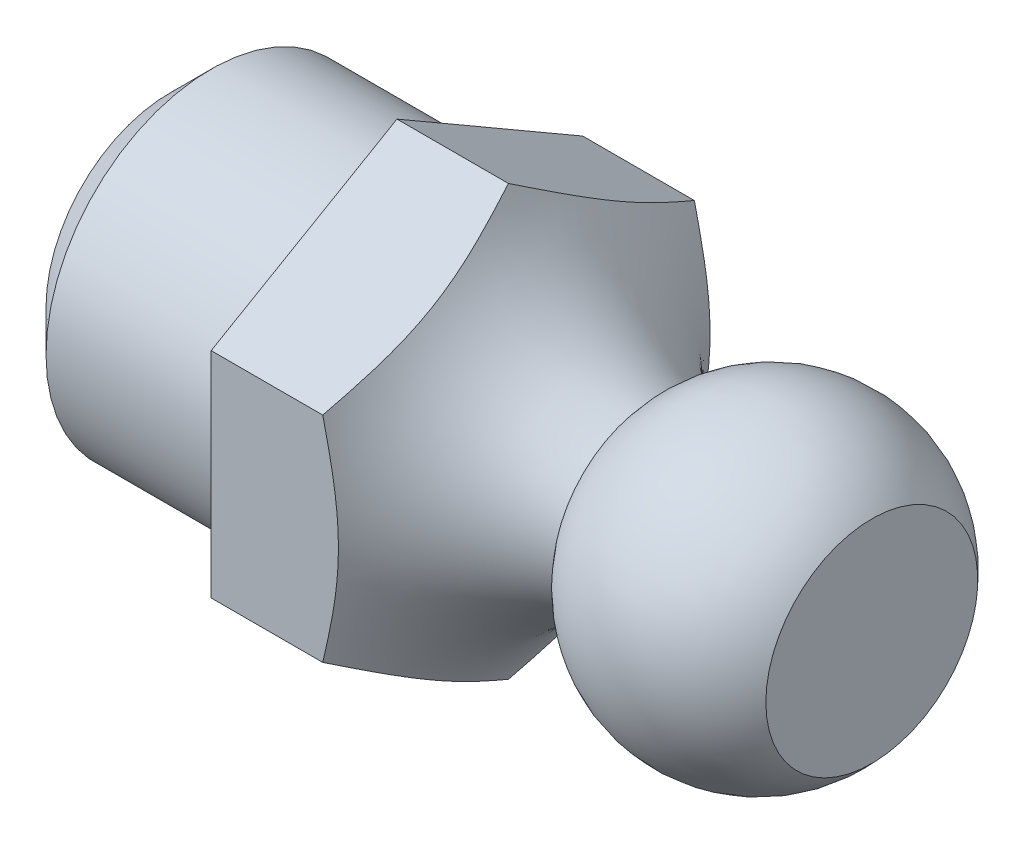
ISO-10303-21;
HEADER;
FILE_DESCRIPTION(('STEP AP214'),'2;1');
FILE_NAME('part.step','',(''),(''),'','','');
FILE_SCHEMA(('AUTOMOTIVE_DESIGN { 1 0 10303 214 1 1 1 1 }'));
ENDSEC;
DATA;
#1=APPLICATION_CONTEXT('core data for automotive mechanical design processes');
#2=APPLICATION_PROTOCOL_DEFINITION('international standard','automotive_design',2000,#1);
#3=PRODUCT_CONTEXT('',#1,'mechanical');
#4=PRODUCT('Part','Part','',(#3));
#5=PRODUCT_RELATED_PRODUCT_CATEGORY('part','',(#4));
#6=PRODUCT_DEFINITION_FORMATION('','',#4);
#7=PRODUCT_DEFINITION_CONTEXT('part definition',#1,'design');
#8=PRODUCT_DEFINITION('design','',#6,#7);
#9=PRODUCT_DEFINITION_SHAPE('','',#8);
#10=(LENGTH_UNIT() NAMED_UNIT(*) SI_UNIT(.MILLI.,.METRE.));
#11=(NAMED_UNIT(*) PLANE_ANGLE_UNIT() SI_UNIT($,.RADIAN.));
#12=(NAMED_UNIT(*) SI_UNIT($,.STERADIAN.) SOLID_ANGLE_UNIT());
#13=UNCERTAINTY_MEASURE_WITH_UNIT(LENGTH_MEASURE(1.E-05),#10,'distance_accuracy_value','');
#14=(GEOMETRIC_REPRESENTATION_CONTEXT(3) GLOBAL_UNCERTAINTY_ASSIGNED_CONTEXT((#13)) GLOBAL_UNIT_ASSIGNED_CONTEXT((#10,
#11,#12)) REPRESENTATION_CONTEXT('',''));
#15=CARTESIAN_POINT('',(0.,0.,0.));
#16=DIRECTION('',(0.,0.,1.));
#17=DIRECTION('',(1.,0.,0.));
#18=AXIS2_PLACEMENT_3D('',#15,#16,#17);
#19=CARTESIAN_POINT('',(5.49999999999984,4.0000000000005,2.0768798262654E-13));
#20=DIRECTION('',(-1.00000000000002,0.,0.));
#21=DIRECTION('',(0.,0.,1.00000000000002));
#22=AXIS2_PLACEMENT_3D('',#19,#20,#21);
#23=PLANE('',#22);
#24=CARTESIAN_POINT('',(5.50000000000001,4.9960036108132E-13,1.04892009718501E-13));
#25=DIRECTION('',(-1.00000000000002,0.,0.));
#26=DIRECTION('',(0.,0.,1.00000000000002));
#27=AXIS2_PLACEMENT_3D('',#24,#25,#26);
#28=CIRCLE('',#27,4.);
#29=CARTESIAN_POINT('',(5.50000000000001,4.69169571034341E-13,4.00000000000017));
#30=VERTEX_POINT('',#29);
#31=EDGE_CURVE('E193',#30,#30,#28,.T.);
#32=ORIENTED_EDGE('',*,*,#31,.F.);
#33=EDGE_LOOP('',(#32));
#34=FACE_BOUND('',#33,.T.);
#35=DIRECTION('',(0.,-0.501108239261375,0.86538461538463));
#36=VECTOR('',#35,1.);
#37=CARTESIAN_POINT('',(5.50000000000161,5.20000000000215,2.05220083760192E-13));
#38=LINE('',#37,#36);
#39=CARTESIAN_POINT('',(5.50000000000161,5.20000000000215,2.05220083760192E-13));
#40=VERTEX_POINT('',#39);
#41=CARTESIAN_POINT('',(5.49999999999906,2.59423715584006,4.50000000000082));
#42=VERTEX_POINT('',#41);
#43=EDGE_CURVE('E112',#40,#42,#38,.T.);
#44=ORIENTED_EDGE('',*,*,#43,.F.);
#45=DIRECTION('',(0.,-0.501108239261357,-0.865384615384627));
#46=VECTOR('',#45,1.);
#47=CARTESIAN_POINT('',(5.50000000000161,5.20000000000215,2.05220083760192E-13));
#48=LINE('',#47,#46);
#49=CARTESIAN_POINT('',(5.49999999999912,2.5942371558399,-4.49999999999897));
#50=VERTEX_POINT('',#49);
#51=EDGE_CURVE('E107',#40,#50,#48,.T.);
#52=ORIENTED_EDGE('',*,*,#51,.T.);
#53=DIRECTION('',(0.,-1.00000000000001,0.));
#54=VECTOR('',#53,1.);
#55=CARTESIAN_POINT('',(5.49999999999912,2.5942371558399,-4.49999999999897));
#56=LINE('',#55,#54);
#57=CARTESIAN_POINT('',(5.49999999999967,-2.59423715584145,-4.49999999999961));
#58=VERTEX_POINT('',#57);
#59=EDGE_CURVE('E105',#50,#58,#56,.T.);
#60=ORIENTED_EDGE('',*,*,#59,.T.);
#61=DIRECTION('',(0.,0.501108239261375,-0.86538461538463));
#62=VECTOR('',#61,1.);
#63=CARTESIAN_POINT('',(5.50000000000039,-5.19999999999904,3.3763084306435E-13));
#64=LINE('',#63,#62);
#65=CARTESIAN_POINT('',(5.50000000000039,-5.19999999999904,3.3763084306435E-13));
#66=VERTEX_POINT('',#65);
#67=EDGE_CURVE('E54',#66,#58,#64,.T.);
#68=ORIENTED_EDGE('',*,*,#67,.F.);
#69=DIRECTION('',(0.,0.501108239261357,0.865384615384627));
#70=VECTOR('',#69,1.);
#71=CARTESIAN_POINT('',(5.50000000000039,-5.19999999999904,3.3763084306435E-13));
#72=LINE('',#71,#70);
#73=CARTESIAN_POINT('',(5.50000000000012,-2.59423715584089,4.5000000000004));
#74=VERTEX_POINT('',#73);
#75=EDGE_CURVE('E94',#66,#74,#72,.T.);
#76=ORIENTED_EDGE('',*,*,#75,.T.);
#77=DIRECTION('',(0.,-1.00000000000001,0.));
#78=VECTOR('',#77,1.);
#79=CARTESIAN_POINT('',(5.49999999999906,2.59423715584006,4.50000000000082));
#80=LINE('',#79,#78);
#81=EDGE_CURVE('E100',#42,#74,#80,.T.);
#82=ORIENTED_EDGE('',*,*,#81,.F.);
#83=EDGE_LOOP('',(#44,#52,#60,#68,#76,#82));
#84=FACE_BOUND('',#83,.T.);
#85=ADVANCED_FACE('F31',(#34,#84),#23,.T.);
#86=CARTESIAN_POINT('',(-3.37556837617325,4.44089209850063E-13,4.47851613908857E-13));
#87=DIRECTION('',(-1.00000000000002,0.,0.));
#88=DIRECTION('',(0.,0.,1.00000000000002));
#89=AXIS2_PLACEMENT_3D('',#86,#87,#88);
#90=CYLINDRICAL_SURFACE('',#89,4.);
#91=CARTESIAN_POINT('',(1.,2.77555756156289E-13,3.31952308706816E-13));
#92=DIRECTION('',(-1.00000000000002,0.,0.));
#93=DIRECTION('',(0.,0.,1.00000000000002));
#94=AXIS2_PLACEMENT_3D('',#91,#92,#93);
#95=CIRCLE('',#94,4.);
#96=CARTESIAN_POINT('',(1.00000000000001,2.4712496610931E-13,4.00000000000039));
#97=VERTEX_POINT('',#96);
#98=EDGE_CURVE('E11',#97,#97,#95,.F.);
#99=ORIENTED_EDGE('',*,*,#98,.T.);
#100=EDGE_LOOP('',(#99));
#101=FACE_BOUND('',#100,.T.);
#102=ORIENTED_EDGE('',*,*,#31,.T.);
#103=EDGE_LOOP('',(#102));
#104=FACE_BOUND('',#103,.T.);
#105=ADVANCED_FACE('F183',(#101,#104),#90,.T.);
#106=CARTESIAN_POINT('',(0.,0.,0.));
#107=DIRECTION('',(-1.00000000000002,0.,0.));
#108=DIRECTION('',(0.,0.,1.00000000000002));
#109=AXIS2_PLACEMENT_3D('',#106,#107,#108);
#110=PLANE('',#109);
#111=CARTESIAN_POINT('',(0.,0.,0.));
#112=DIRECTION('',(-1.00000000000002,0.,0.));
#113=DIRECTION('',(0.,0.,1.00000000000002));
#114=AXIS2_PLACEMENT_3D('',#111,#112,#113);
#115=CIRCLE('',#114,2.99999999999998);
#116=CARTESIAN_POINT('',(0.,0.,3.00000000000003));
#117=VERTEX_POINT('',#116);
#118=EDGE_CURVE('E39',#117,#117,#115,.T.);
#119=ORIENTED_EDGE('',*,*,#118,.T.);
#120=EDGE_LOOP('',(#119));
#121=FACE_BOUND('',#120,.T.);
#122=ADVANCED_FACE('F179',(#121),#110,.T.);
#123=CARTESIAN_POINT('',(0.,0.,0.));
#124=DIRECTION('',(1.00000000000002,0.,0.));
#125=DIRECTION('',(0.,0.,-1.00000000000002));
#126=AXIS2_PLACEMENT_3D('',#123,#124,#125);
#127=CONICAL_SURFACE('',#126,2.99999999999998,0.785398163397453);
#128=ORIENTED_EDGE('',*,*,#98,.F.);
#129=EDGE_LOOP('',(#128));
#130=FACE_BOUND('',#129,.T.);
#131=ORIENTED_EDGE('',*,*,#118,.F.);
#132=EDGE_LOOP('',(#131));
#133=FACE_BOUND('',#132,.T.);
#134=ADVANCED_FACE('F176',(#130,#133),#127,.T.);
#135=CARTESIAN_POINT('',(8.79999999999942,5.20000000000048,2.0154190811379E-13));
#136=DIRECTION('',(0.,0.865384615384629,-0.501108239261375));
#137=DIRECTION('',(0.,0.501108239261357,0.865384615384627));
#138=AXIS2_PLACEMENT_3D('',#135,#136,#137);
#139=PLANE('',#138);
#140=DIRECTION('',(-1.00000000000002,0.,0.));
#141=VECTOR('',#140,1.);
#142=CARTESIAN_POINT('',(8.79999999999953,2.59423715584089,-4.49999999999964));
#143=LINE('',#142,#141);
#144=CARTESIAN_POINT('',(8.20267160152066,2.59423715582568,-4.49999999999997));
#145=VERTEX_POINT('',#144);
#146=EDGE_CURVE('E46',#145,#50,#143,.T.);
#147=ORIENTED_EDGE('',*,*,#146,.T.);
#148=ORIENTED_EDGE('',*,*,#51,.F.);
#149=DIRECTION('',(-1.00000000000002,0.,0.));
#150=VECTOR('',#149,1.);
#151=CARTESIAN_POINT('',(8.79999999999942,5.20000000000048,2.0154190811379E-13));
#152=LINE('',#151,#150);
#153=CARTESIAN_POINT('',(8.19999999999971,5.19999999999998,2.02210667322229E-13));
#154=VERTEX_POINT('',#153);
#155=EDGE_CURVE('E120',#154,#40,#152,.T.);
#156=ORIENTED_EDGE('',*,*,#155,.F.);
#157=CARTESIAN_POINT('',(8.20261804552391,2.59412134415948,-4.50019999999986));
#158=CARTESIAN_POINT('',(8.2387492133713,2.67233379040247,-4.36513168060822));
#159=CARTESIAN_POINT('',(8.27456950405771,2.75060361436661,-4.22996427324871));
#160=CARTESIAN_POINT('',(8.34335370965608,2.90757523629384,-3.95888346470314));
#161=CARTESIAN_POINT('',(8.37631333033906,2.98627750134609,-3.82296925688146));
#162=CARTESIAN_POINT('',(8.43708874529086,3.14437672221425,-3.54994115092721));
#163=CARTESIAN_POINT('',(8.46489296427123,3.22377483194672,-3.41282526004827));
#164=CARTESIAN_POINT('',(8.51283171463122,3.38312633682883,-3.13763453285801));
#165=CARTESIAN_POINT('',(8.53297023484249,3.46307942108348,-2.99956023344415));
#166=CARTESIAN_POINT('',(8.56315527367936,3.62149149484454,-2.72599184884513));
#167=CARTESIAN_POINT('',(8.57343811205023,3.69993878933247,-2.59051796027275));
#168=CARTESIAN_POINT('',(8.58362741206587,3.85701288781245,-2.31926018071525));
#169=CARTESIAN_POINT('',(8.58353335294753,3.93563970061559,-2.18347627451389));
#170=CARTESIAN_POINT('',(8.5729897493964,4.09254682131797,-1.91250685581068));
#171=CARTESIAN_POINT('',(8.56256192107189,4.17082751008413,-1.77732068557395));
#172=CARTESIAN_POINT('',(8.53252572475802,4.32693403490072,-1.50773384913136));
#173=CARTESIAN_POINT('',(8.51291695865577,4.40475985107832,-1.37333321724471));
#174=CARTESIAN_POINT('',(8.47168038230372,4.54234271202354,-1.13573566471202));
#175=CARTESIAN_POINT('',(8.45150728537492,4.60221318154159,-1.03234286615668));
#176=CARTESIAN_POINT('',(8.40782130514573,4.72166483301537,-0.826056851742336));
#177=CARTESIAN_POINT('',(8.38430730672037,4.78124591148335,-0.723163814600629));
#178=CARTESIAN_POINT('',(8.33470644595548,4.90081638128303,-0.516672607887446));
#179=CARTESIAN_POINT('',(8.30859417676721,4.96080307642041,-0.413079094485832));
#180=CARTESIAN_POINT('',(8.25503094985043,5.08057404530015,-0.206241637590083));
#181=CARTESIAN_POINT('',(8.22758113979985,5.1403584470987,-0.102997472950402));
#182=CARTESIAN_POINT('',(8.19994641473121,5.20011581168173,0.000200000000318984));
#183=B_SPLINE_CURVE_WITH_KNOTS('',3,(#157,#158,#159,#160,#161,#162,#163,#164,#165,#166,#167,
#168,#169,#170,#171,#172,#173,#174,#175,#176,#177,#178,#179,#180,#181,#182),.UNSPECIFIED.,.F.,
.F.,(4,2,2,2,2,2,2,2,2,2,2,2,4),(0.,0.480686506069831,0.962082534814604,1.44454667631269,
1.92675942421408,2.39709683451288,2.86745784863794,3.33683250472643,3.80622751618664,
4.16967424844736,4.53324257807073,4.90080141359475,5.26805023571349),.UNSPECIFIED.);
#184=EDGE_CURVE('E166',#145,#154,#183,.T.);
#185=ORIENTED_EDGE('',*,*,#184,.F.);
#186=EDGE_LOOP('',(#147,#148,#156,#185));
#187=FACE_BOUND('',#186,.T.);
#188=ADVANCED_FACE('F141',(#187),#139,.T.);
#189=CARTESIAN_POINT('',(8.79999999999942,5.20000000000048,2.0154190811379E-13));
#190=DIRECTION('',(0.,-0.865384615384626,-0.501108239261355));
#191=DIRECTION('',(0.,0.501108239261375,-0.86538461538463));
#192=AXIS2_PLACEMENT_3D('',#189,#190,#191);
#193=PLANE('',#192);
#194=CARTESIAN_POINT('',(8.20261804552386,2.59412134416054,4.50020000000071));
#195=CARTESIAN_POINT('',(8.23874921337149,2.67233379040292,4.36513168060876));
#196=CARTESIAN_POINT('',(8.27456950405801,2.75060361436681,4.22996427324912));
#197=CARTESIAN_POINT('',(8.34335370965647,2.90757523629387,3.95888346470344));
#198=CARTESIAN_POINT('',(8.37631333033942,2.98627750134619,3.82296925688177));
#199=CARTESIAN_POINT('',(8.43708874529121,3.1443767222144,3.54994115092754));
#200=CARTESIAN_POINT('',(8.46489296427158,3.22377483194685,3.41282526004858));
#201=CARTESIAN_POINT('',(8.51283171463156,3.38312633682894,3.13763453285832));
#202=CARTESIAN_POINT('',(8.53297023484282,3.4630794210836,2.99956023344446));
#203=CARTESIAN_POINT('',(8.56315527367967,3.62149149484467,2.72599184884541));
#204=CARTESIAN_POINT('',(8.57343811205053,3.6999387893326,2.590517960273));
#205=CARTESIAN_POINT('',(8.58362741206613,3.85701288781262,2.31926018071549));
#206=CARTESIAN_POINT('',(8.58353335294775,3.93563970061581,2.18347627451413));
#207=CARTESIAN_POINT('',(8.5729897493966,4.09254682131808,1.91250685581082));
#208=CARTESIAN_POINT('',(8.56256192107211,4.17082751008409,1.77732068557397));
#209=CARTESIAN_POINT('',(8.53252572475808,4.32693403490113,1.50773384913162));
#210=CARTESIAN_POINT('',(8.51291695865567,4.40475985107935,1.37333321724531));
#211=CARTESIAN_POINT('',(8.47168038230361,4.5423427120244,1.13573566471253));
#212=CARTESIAN_POINT('',(8.45150728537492,4.60221318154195,1.03234286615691));
#213=CARTESIAN_POINT('',(8.4078213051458,4.72166483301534,0.826056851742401));
#214=CARTESIAN_POINT('',(8.38430730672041,4.78124591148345,0.723163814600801));
#215=CARTESIAN_POINT('',(8.33470644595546,4.90081638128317,0.516672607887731));
#216=CARTESIAN_POINT('',(8.30859417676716,4.96080307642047,0.413079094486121));
#217=CARTESIAN_POINT('',(8.25503094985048,5.08057404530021,0.206241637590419));
#218=CARTESIAN_POINT('',(8.22758113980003,5.14035844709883,0.102997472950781));
#219=CARTESIAN_POINT('',(8.19994641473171,5.20011581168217,-0.00019999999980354));
#220=B_SPLINE_CURVE_WITH_KNOTS('',3,(#194,#195,#196,#197,#198,#199,#200,#201,#202,#203,#204,
#205,#206,#207,#208,#209,#210,#211,#212,#213,#214,#215,#216,#217,#218,#219),.UNSPECIFIED.,.F.,
.F.,(4,2,2,2,2,2,2,2,2,2,2,2,4),(0.,0.48068650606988,0.962082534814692,1.44454667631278,
1.92675942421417,2.39709683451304,2.86745784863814,3.3368325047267,3.80622751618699,
4.16967424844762,4.5332425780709,4.90080141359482,5.26805023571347),.UNSPECIFIED.);
#221=CARTESIAN_POINT('',(8.20267160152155,2.59423715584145,4.50000000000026));
#222=VERTEX_POINT('',#221);
#223=EDGE_CURVE('E161',#222,#154,#220,.T.);
#224=ORIENTED_EDGE('',*,*,#223,.T.);
#225=ORIENTED_EDGE('',*,*,#155,.T.);
#226=ORIENTED_EDGE('',*,*,#43,.T.);
#227=DIRECTION('',(-1.00000000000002,0.,0.));
#228=VECTOR('',#227,1.);
#229=CARTESIAN_POINT('',(8.79999999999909,2.59423715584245,4.50000000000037));
#230=LINE('',#229,#228);
#231=EDGE_CURVE('E118',#222,#42,#230,.T.);
#232=ORIENTED_EDGE('',*,*,#231,.F.);
#233=EDGE_LOOP('',(#224,#225,#226,#232));
#234=FACE_BOUND('',#233,.T.);
#235=ADVANCED_FACE('F171',(#234),#193,.F.);
#236=CARTESIAN_POINT('',(8.79999999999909,2.59423715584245,4.50000000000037));
#237=DIRECTION('',(0.,0.,-1.00000000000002));
#238=DIRECTION('',(-1.00000000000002,0.,0.));
#239=AXIS2_PLACEMENT_3D('',#236,#237,#238);
#240=PLANE('',#239);
#241=CARTESIAN_POINT('',(8.5822954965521,-6.66133814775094E-13,4.50000000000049));
#242=CARTESIAN_POINT('',(8.58229921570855,0.119326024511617,4.50000000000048));
#243=CARTESIAN_POINT('',(8.57926174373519,0.238646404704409,4.50000000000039));
#244=CARTESIAN_POINT('',(8.56732149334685,0.476990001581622,4.50000000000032));
#245=CARTESIAN_POINT('',(8.55841871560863,0.596013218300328,4.50000000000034));
#246=CARTESIAN_POINT('',(8.53528789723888,0.833703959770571,4.50000000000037));
#247=CARTESIAN_POINT('',(8.52105215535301,0.952370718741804,4.50000000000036));
#248=CARTESIAN_POINT('',(8.48807886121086,1.18907045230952,4.50000000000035));
#249=CARTESIAN_POINT('',(8.46934116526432,1.30710340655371,4.50000000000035));
#250=CARTESIAN_POINT('',(8.40719317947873,1.66382464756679,4.50000000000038));
#251=CARTESIAN_POINT('',(8.35825321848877,1.9015291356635,4.50000000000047));
#252=CARTESIAN_POINT('',(8.25400830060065,2.375374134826,4.50000000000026));
#253=CARTESIAN_POINT('',(8.19870488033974,2.61151500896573,4.49999999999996));
#254=CARTESIAN_POINT('',(8.10863196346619,2.99851345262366,4.5000000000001));
#255=CARTESIAN_POINT('',(8.07367089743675,3.14932276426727,4.5000000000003));
#256=CARTESIAN_POINT('',(8.00551907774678,3.45134310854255,4.50000000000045));
#257=CARTESIAN_POINT('',(7.97232830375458,3.60255413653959,4.5000000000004));
#258=CARTESIAN_POINT('',(7.90905025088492,3.9056422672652,4.50000000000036));
#259=CARTESIAN_POINT('',(7.87896309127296,4.05751939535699,4.50000000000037));
#260=CARTESIAN_POINT('',(7.8230430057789,4.3620519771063,4.50000000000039));
#261=CARTESIAN_POINT('',(7.79721003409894,4.51470742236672,4.5000000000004));
#262=CARTESIAN_POINT('',(7.72809516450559,4.97092033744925,4.50000000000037));
#263=CARTESIAN_POINT('',(7.69252926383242,5.27572486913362,4.50000000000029));
#264=CARTESIAN_POINT('',(7.6487081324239,5.88733722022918,4.50000000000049));
#265=CARTESIAN_POINT('',(7.6404389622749,6.19414393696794,4.50000000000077));
#266=CARTESIAN_POINT('',(7.6534467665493,6.70311838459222,4.50000000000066));
#267=CARTESIAN_POINT('',(7.66566455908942,6.90552892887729,4.50000000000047));
#268=CARTESIAN_POINT('',(7.70526264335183,7.30884190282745,4.50000000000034));
#269=CARTESIAN_POINT('',(7.73263854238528,7.50974475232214,4.50000000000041));
#270=CARTESIAN_POINT('',(7.8035200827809,7.90940380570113,4.50000000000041));
#271=CARTESIAN_POINT('',(7.84707954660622,8.10815054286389,4.50000000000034));
#272=CARTESIAN_POINT('',(7.95089586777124,8.50126205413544,4.50000000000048));
#273=CARTESIAN_POINT('',(8.01115294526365,8.69562677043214,4.50000000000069));
#274=CARTESIAN_POINT('',(8.1491072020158,9.07951323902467,4.50000000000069));
#275=CARTESIAN_POINT('',(8.22691486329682,9.2689954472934,4.50000000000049));
#276=CARTESIAN_POINT('',(8.39975193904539,9.63996572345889,4.50000000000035));
#277=CARTESIAN_POINT('',(8.49478187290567,9.82145355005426,4.50000000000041));
#278=CARTESIAN_POINT('',(8.70163476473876,10.1743217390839,4.50000000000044));
#279=CARTESIAN_POINT('',(8.81343766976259,10.3457138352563,4.50000000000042));
#280=CARTESIAN_POINT('',(9.0533065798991,10.6767105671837,4.50000000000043));
#281=CARTESIAN_POINT('',(9.18137045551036,10.8363167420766,4.50000000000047));
#282=CARTESIAN_POINT('',(9.4377534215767,11.1249014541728,4.50000000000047));
#283=CARTESIAN_POINT('',(9.56446315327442,11.2553126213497,4.50000000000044));
#284=CARTESIAN_POINT('',(9.82917982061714,11.5041140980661,4.50000000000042));
#285=CARTESIAN_POINT('',(9.96718579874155,11.6225054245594,4.50000000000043));
#286=CARTESIAN_POINT('',(10.2534745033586,11.8460810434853,4.50000000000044));
#287=CARTESIAN_POINT('',(10.4017553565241,11.9512677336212,4.50000000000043));
#288=CARTESIAN_POINT('',(10.7074607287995,12.1473904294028,4.50000000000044));
#289=CARTESIAN_POINT('',(10.864884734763,12.2383272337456,4.50000000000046));
#290=CARTESIAN_POINT('',(11.174589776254,12.3983024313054,4.50000000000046));
#291=CARTESIAN_POINT('',(11.3262661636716,12.4685138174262,4.50000000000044));
#292=CARTESIAN_POINT('',(11.6351510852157,12.5954679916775,4.50000000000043));
#293=CARTESIAN_POINT('',(11.7923592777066,12.6522116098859,4.50000000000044));
#294=CARTESIAN_POINT('',(12.1110970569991,12.7517070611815,4.50000000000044));
#295=CARTESIAN_POINT('',(12.2726254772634,12.7944626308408,4.50000000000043));
#296=CARTESIAN_POINT('',(12.5988161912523,12.8656134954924,4.50000000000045));
#297=CARTESIAN_POINT('',(12.7634784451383,12.8940089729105,4.50000000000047));
#298=CARTESIAN_POINT('',(13.0887021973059,12.9354210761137,4.50000000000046));
#299=CARTESIAN_POINT('',(13.2491981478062,12.9489541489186,4.50000000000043));
#300=CARTESIAN_POINT('',(13.5708156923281,12.9623210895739,4.50000000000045));
#301=CARTESIAN_POINT('',(13.7319374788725,12.9621503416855,4.5000000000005));
#302=CARTESIAN_POINT('',(14.0535083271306,12.9481023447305,4.50000000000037));
#303=CARTESIAN_POINT('',(14.2139576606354,12.934231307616,4.50000000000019));
#304=CARTESIAN_POINT('',(14.5331569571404,12.8929030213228,4.50000000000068));
#305=CARTESIAN_POINT('',(14.6919062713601,12.8654407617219,4.50000000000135));
#306=CARTESIAN_POINT('',(15.0049969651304,12.7974895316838,4.50000000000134));
#307=CARTESIAN_POINT('',(15.1593660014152,12.7571278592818,4.50000000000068));
#308=CARTESIAN_POINT('',(15.4642440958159,12.6636236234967,4.50000000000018));
#309=CARTESIAN_POINT('',(15.6147517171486,12.6104763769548,4.50000000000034));
#310=CARTESIAN_POINT('',(15.9107740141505,12.4918662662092,4.50000000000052));
#311=CARTESIAN_POINT('',(16.0562902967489,12.4264074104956,4.50000000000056));
#312=CARTESIAN_POINT('',(16.3414800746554,12.2836642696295,4.5000000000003));
#313=CARTESIAN_POINT('',(16.4811509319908,12.2063747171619,4.50000000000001));
#314=CARTESIAN_POINT('',(16.7554224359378,12.0395557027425,4.50000000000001));
#315=CARTESIAN_POINT('',(16.8899359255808,11.9498829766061,4.50000000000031));
#316=CARTESIAN_POINT('',(17.1510844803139,11.7598308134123,4.50000000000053));
#317=CARTESIAN_POINT('',(17.2777227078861,11.6594557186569,4.50000000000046));
#318=CARTESIAN_POINT('',(17.5224404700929,11.4487549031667,4.50000000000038));
#319=CARTESIAN_POINT('',(17.6405194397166,11.3384285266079,4.50000000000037));
#320=CARTESIAN_POINT('',(17.8674280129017,11.1087173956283,4.50000000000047));
#321=CARTESIAN_POINT('',(17.9762604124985,10.9893354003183,4.50000000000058));
#322=CARTESIAN_POINT('',(18.1879956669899,10.7378420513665,4.50000000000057));
#323=CARTESIAN_POINT('',(18.2905347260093,10.6054244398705,4.50000000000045));
#324=CARTESIAN_POINT('',(18.4846427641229,10.3328446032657,4.50000000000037));
#325=CARTESIAN_POINT('',(18.5762147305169,10.1926845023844,4.50000000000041));
#326=CARTESIAN_POINT('',(18.7482253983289,9.90539812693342,4.5000000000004));
#327=CARTESIAN_POINT('',(18.8286462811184,9.75826119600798,4.50000000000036));
#328=CARTESIAN_POINT('',(18.9779659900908,9.45831078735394,4.50000000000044));
#329=CARTESIAN_POINT('',(19.0468676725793,9.3054987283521,4.50000000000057));
#330=CARTESIAN_POINT('',(19.1777358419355,8.98381945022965,4.50000000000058));
#331=CARTESIAN_POINT('',(19.2388258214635,8.81459567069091,4.50000000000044));
#332=CARTESIAN_POINT('',(19.3477935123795,8.47195693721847,4.50000000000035));
#333=CARTESIAN_POINT('',(19.3956706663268,8.29854180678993,4.5000000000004));
#334=CARTESIAN_POINT('',(19.4783387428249,7.94928727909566,4.50000000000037));
#335=CARTESIAN_POINT('',(19.5131759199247,7.77345878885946,4.50000000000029));
#336=CARTESIAN_POINT('',(19.5704529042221,7.41981126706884,4.50000000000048));
#337=CARTESIAN_POINT('',(19.5928919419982,7.24199211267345,4.50000000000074));
#338=CARTESIAN_POINT('',(19.6350448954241,6.78728705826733,4.50000000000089));
#339=CARTESIAN_POINT('',(19.6464979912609,6.50961393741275,4.50000000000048));
#340=CARTESIAN_POINT('',(19.6440574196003,5.95438035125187,4.50000000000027));
#341=CARTESIAN_POINT('',(19.6301500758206,5.67682002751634,4.50000000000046));
#342=CARTESIAN_POINT('',(19.5806571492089,5.12044337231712,4.50000000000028));
#343=CARTESIAN_POINT('',(19.5448181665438,4.84165075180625,4.4999999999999));
#344=CARTESIAN_POINT('',(19.4564131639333,4.28680008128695,4.50000000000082));
#345=CARTESIAN_POINT('',(19.4038440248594,4.01074255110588,4.50000000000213));
#346=CARTESIAN_POINT('',(19.3025837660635,3.52763197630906,4.50000000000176));
#347=CARTESIAN_POINT('',(19.2560526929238,3.32010650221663,4.50000000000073));
#348=CARTESIAN_POINT('',(19.1607533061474,2.90554086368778,4.49999999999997));
#349=CARTESIAN_POINT('',(19.1119846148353,2.69850078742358,4.50000000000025));
#350=CARTESIAN_POINT('',(19.0166000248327,2.28421457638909,4.50000000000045));
#351=CARTESIAN_POINT('',(18.9699812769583,2.07696910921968,4.50000000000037));
#352=CARTESIAN_POINT('',(18.8839797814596,1.6609002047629,4.50000000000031));
#353=CARTESIAN_POINT('',(18.8445967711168,1.45207682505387,4.50000000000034));
#354=CARTESIAN_POINT('',(18.7953608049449,1.13880843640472,4.50000000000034));
#355=CARTESIAN_POINT('',(18.7806606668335,1.03513373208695,4.50000000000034));
#356=CARTESIAN_POINT('',(18.7549788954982,0.827329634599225,4.50000000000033));
#357=CARTESIAN_POINT('',(18.7439968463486,0.723200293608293,4.50000000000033));
#358=CARTESIAN_POINT('',(18.7262580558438,0.514625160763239,4.50000000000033));
#359=CARTESIAN_POINT('',(18.7194993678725,0.410179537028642,4.50000000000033));
#360=CARTESIAN_POINT('',(18.7105310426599,0.201091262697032,4.50000000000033));
#361=CARTESIAN_POINT('',(18.7083213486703,0.0964486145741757,4.50000000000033));
#362=CARTESIAN_POINT('',(18.7085635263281,-0.112797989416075,4.50000000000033));
#363=CARTESIAN_POINT('',(18.7110139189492,-0.217401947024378,4.50000000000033));
#364=CARTESIAN_POINT('',(18.7204486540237,-0.42640328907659,4.50000000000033));
#365=CARTESIAN_POINT('',(18.7274330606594,-0.530800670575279,4.50000000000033));
#366=CARTESIAN_POINT('',(18.7455984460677,-0.73927418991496,4.50000000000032));
#367=CARTESIAN_POINT('',(18.7567814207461,-0.843350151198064,4.50000000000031));
#368=CARTESIAN_POINT('',(18.7828340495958,-1.05104310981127,4.50000000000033));
#369=CARTESIAN_POINT('',(18.7977040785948,-1.15466005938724,4.50000000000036));
#370=CARTESIAN_POINT('',(18.8392686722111,-1.41653518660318,4.50000000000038));
#371=CARTESIAN_POINT('',(18.86803986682,-1.57446081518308,4.50000000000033));
#372=CARTESIAN_POINT('',(18.9304039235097,-1.88928648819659,4.5000000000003));
#373=CARTESIAN_POINT('',(18.9639956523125,-2.04618676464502,4.50000000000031));
#374=CARTESIAN_POINT('',(19.0337392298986,-2.35963707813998,4.50000000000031));
#375=CARTESIAN_POINT('',(19.0698945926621,-2.51618631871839,4.50000000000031));
#376=CARTESIAN_POINT('',(19.142646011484,-2.82918197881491,4.5000000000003));
#377=CARTESIAN_POINT('',(19.1792420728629,-2.98562839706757,4.5000000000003));
#378=CARTESIAN_POINT('',(19.2515223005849,-3.30081578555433,4.5000000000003));
#379=CARTESIAN_POINT('',(19.2871891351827,-3.45956080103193,4.5000000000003));
#380=CARTESIAN_POINT('',(19.3555096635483,-3.77770600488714,4.5000000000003));
#381=CARTESIAN_POINT('',(19.3881633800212,-3.93710618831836,4.50000000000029));
#382=CARTESIAN_POINT('',(19.4490400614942,-4.25662335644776,4.5000000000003));
#383=CARTESIAN_POINT('',(19.4772667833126,-4.41673961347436,4.50000000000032));
#384=CARTESIAN_POINT('',(19.5281169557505,-4.73785430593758,4.50000000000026));
#385=CARTESIAN_POINT('',(19.5507407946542,-4.89885267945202,4.50000000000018));
#386=CARTESIAN_POINT('',(19.5977440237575,-5.29208876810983,4.50000000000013));
#387=CARTESIAN_POINT('',(19.618585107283,-5.52477004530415,4.50000000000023));
#388=CARTESIAN_POINT('',(19.6438622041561,-5.99111623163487,4.50000000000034));
#389=CARTESIAN_POINT('',(19.6482951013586,-6.22478131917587,4.50000000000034));
#390=CARTESIAN_POINT('',(19.6385955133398,-6.69158542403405,4.50000000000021));
#391=CARTESIAN_POINT('',(19.6244780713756,-6.92472471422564,4.50000000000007));
#392=CARTESIAN_POINT('',(19.5760078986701,-7.38890026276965,4.50000000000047));
#393=CARTESIAN_POINT('',(19.5416598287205,-7.61993699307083,4.50000000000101));
#394=CARTESIAN_POINT('',(19.4598706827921,-8.03540301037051,4.50000000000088));
#395=CARTESIAN_POINT('',(19.4160297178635,-8.22054391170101,4.50000000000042));
#396=CARTESIAN_POINT('',(19.3136952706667,-8.58672054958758,4.50000000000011));
#397=CARTESIAN_POINT('',(19.2552045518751,-8.76775705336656,4.50000000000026));
#398=CARTESIAN_POINT('',(19.1234012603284,-9.1242274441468,4.50000000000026));
#399=CARTESIAN_POINT('',(19.0500987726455,-9.2996650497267,4.50000000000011));
#400=CARTESIAN_POINT('',(18.8886596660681,-9.64359808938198,4.5000000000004));
#401=CARTESIAN_POINT('',(18.8005227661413,-9.81209339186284,4.50000000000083));
#402=CARTESIAN_POINT('',(18.6091478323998,-10.1414960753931,4.50000000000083));
#403=CARTESIAN_POINT('',(18.5058319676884,-10.3023583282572,4.5000000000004));
#404=CARTESIAN_POINT('',(18.2849247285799,-10.6139836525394,4.5000000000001));
#405=CARTESIAN_POINT('',(18.1673330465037,-10.7647465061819,4.50000000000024));
#406=CARTESIAN_POINT('',(17.9185558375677,-11.0546751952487,4.50000000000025));
#407=CARTESIAN_POINT('',(17.7873673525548,-11.1938384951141,4.50000000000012));
#408=CARTESIAN_POINT('',(17.5123518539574,-11.4590563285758,4.50000000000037));
#409=CARTESIAN_POINT('',(17.3685260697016,-11.5851121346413,4.50000000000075));
#410=CARTESIAN_POINT('',(17.0833469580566,-11.8116523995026,4.5000000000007));
#411=CARTESIAN_POINT('',(16.9430153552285,-11.9134253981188,4.50000000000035));
#412=CARTESIAN_POINT('',(16.653888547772,-12.104139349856,4.50000000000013));
#413=CARTESIAN_POINT('',(16.5050938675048,-12.1930810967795,4.50000000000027));
#414=CARTESIAN_POINT('',(16.2002157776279,-12.357260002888,4.50000000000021));
#415=CARTESIAN_POINT('',(16.0441358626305,-12.432503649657,4.50000000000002));
#416=CARTESIAN_POINT('',(15.7258288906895,-12.5686192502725,4.50000000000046));
#417=CARTESIAN_POINT('',(15.5636020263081,-12.629491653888,4.50000000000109));
#418=CARTESIAN_POINT('',(15.243484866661,-12.7332982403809,4.50000000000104));
#419=CARTESIAN_POINT('',(15.085856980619,-12.7770432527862,4.50000000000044));
#420=CARTESIAN_POINT('',(14.7673660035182,-12.8508291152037,4.50000000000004));
#421=CARTESIAN_POINT('',(14.6065018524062,-12.8808653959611,4.50000000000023));
#422=CARTESIAN_POINT('',(14.2828580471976,-12.9269359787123,4.50000000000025));
#423=CARTESIAN_POINT('',(14.1200793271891,-12.9429768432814,4.50000000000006));
#424=CARTESIAN_POINT('',(13.7936833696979,-12.9609424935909,4.50000000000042));
#425=CARTESIAN_POINT('',(13.6300658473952,-12.9628621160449,4.50000000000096));
#426=CARTESIAN_POINT('',(13.306980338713,-12.9526719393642,4.50000000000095));
#427=CARTESIAN_POINT('',(13.1475022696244,-12.9408787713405,4.50000000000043));
#428=CARTESIAN_POINT('',(12.8300512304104,-12.9038727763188,4.50000000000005));
#429=CARTESIAN_POINT('',(12.672078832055,-12.8786550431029,4.50000000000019));
#430=CARTESIAN_POINT('',(12.3588926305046,-12.8150239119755,4.50000000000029));
#431=CARTESIAN_POINT('',(12.2036775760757,-12.7766166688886,4.50000000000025));
#432=CARTESIAN_POINT('',(11.8969466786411,-12.6869050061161,4.50000000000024));
#433=CARTESIAN_POINT('',(11.7454325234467,-12.6355948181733,4.50000000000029));
#434=CARTESIAN_POINT('',(11.4470690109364,-12.520454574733,4.50000000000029));
#435=CARTESIAN_POINT('',(11.3002243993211,-12.4566122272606,4.50000000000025));
#436=CARTESIAN_POINT('',(11.0124027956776,-12.3169942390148,4.50000000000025));
#437=CARTESIAN_POINT('',(10.8714233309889,-12.2412236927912,4.50000000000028));
#438=CARTESIAN_POINT('',(10.5961220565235,-12.0783090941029,4.50000000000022));
#439=CARTESIAN_POINT('',(10.4618029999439,-11.9911603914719,4.50000000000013));
#440=CARTESIAN_POINT('',(10.2007610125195,-11.8062377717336,4.50000000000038));
#441=CARTESIAN_POINT('',(10.0740356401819,-11.7084672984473,4.50000000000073));
#442=CARTESIAN_POINT('',(9.82600046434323,-11.5006286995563,4.50000000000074));
#443=CARTESIAN_POINT('',(9.70488719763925,-11.3903260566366,4.50000000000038));
#444=CARTESIAN_POINT('',(9.47207155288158,-11.1602761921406,4.50000000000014));
#445=CARTESIAN_POINT('',(9.36036635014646,-11.0405318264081,4.50000000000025));
#446=CARTESIAN_POINT('',(9.14686673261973,-10.7924532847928,4.50000000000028));
#447=CARTESIAN_POINT('',(9.04507541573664,-10.6641164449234,4.50000000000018));
#448=CARTESIAN_POINT('',(8.85192604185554,-10.3998802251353,4.50000000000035));
#449=CARTESIAN_POINT('',(8.76056524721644,-10.2639828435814,4.50000000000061));
#450=CARTESIAN_POINT('',(8.58420192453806,-9.97847984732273,4.50000000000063));
#451=CARTESIAN_POINT('',(8.49975902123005,-9.82852856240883,4.50000000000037));
#452=CARTESIAN_POINT('',(8.34296587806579,-9.52243954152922,4.50000000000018));
#453=CARTESIAN_POINT('',(8.27061598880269,-9.36630162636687,4.50000000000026));
#454=CARTESIAN_POINT('',(8.13806945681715,-9.0488888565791,4.5000000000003));
#455=CARTESIAN_POINT('',(8.07787751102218,-8.88761204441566,4.50000000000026));
#456=CARTESIAN_POINT('',(7.96961070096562,-8.56103759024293,4.50000000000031));
#457=CARTESIAN_POINT('',(7.92153710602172,-8.39573952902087,4.5000000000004));
#458=CARTESIAN_POINT('',(7.83323163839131,-8.04603118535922,4.50000000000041));
#459=CARTESIAN_POINT('',(7.7942052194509,-7.86131665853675,4.5000000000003));
#460=CARTESIAN_POINT('',(7.72999313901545,-7.489506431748,4.50000000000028));
#461=CARTESIAN_POINT('',(7.70480853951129,-7.30241055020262,4.50000000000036));
#462=CARTESIAN_POINT('',(7.66762008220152,-6.92718043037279,4.50000000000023));
#463=CARTESIAN_POINT('',(7.65559899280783,-6.73904787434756,4.50000000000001));
#464=CARTESIAN_POINT('',(7.64379600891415,-6.36239670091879,4.50000000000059));
#465=CARTESIAN_POINT('',(7.64401575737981,-6.1738780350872,4.50000000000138));
#466=CARTESIAN_POINT('',(7.65586109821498,-5.78939810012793,4.50000000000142));
#467=CARTESIAN_POINT('',(7.66795908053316,-5.59345222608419,4.5000000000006));
#468=CARTESIAN_POINT('',(7.70281570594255,-5.20251694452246,4.50000000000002));
#469=CARTESIAN_POINT('',(7.7255756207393,-5.00752765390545,4.50000000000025));
#470=CARTESIAN_POINT('',(7.78018374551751,-4.61783051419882,4.50000000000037));
#471=CARTESIAN_POINT('',(7.81207811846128,-4.42312927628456,4.50000000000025));
#472=CARTESIAN_POINT('',(7.88285686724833,-4.0350813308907,4.50000000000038));
#473=CARTESIAN_POINT('',(7.92173942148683,-3.8417342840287,4.50000000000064));
#474=CARTESIAN_POINT('',(7.99540591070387,-3.49664006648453,4.50000000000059));
#475=CARTESIAN_POINT('',(8.02932918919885,-3.3447050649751,4.5000000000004));
#476=CARTESIAN_POINT('',(8.09862435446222,-3.04116233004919,4.50000000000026));
#477=CARTESIAN_POINT('',(8.13399630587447,-2.88955461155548,4.50000000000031));
#478=CARTESIAN_POINT('',(8.2046154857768,-2.58613436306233,4.50000000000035));
#479=CARTESIAN_POINT('',(8.2398625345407,-2.43432179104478,4.50000000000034));
#480=CARTESIAN_POINT('',(8.30833403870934,-2.13023007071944,4.50000000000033));
#481=CARTESIAN_POINT('',(8.34155847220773,-1.977950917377,4.50000000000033));
#482=CARTESIAN_POINT('',(8.40344184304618,-1.6747756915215,4.50000000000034));
#483=CARTESIAN_POINT('',(8.43216062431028,-1.52389211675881,4.50000000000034));
#484=CARTESIAN_POINT('',(8.48349410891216,-1.22109706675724,4.50000000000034));
#485=CARTESIAN_POINT('',(8.50611021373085,-1.06918583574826,4.50000000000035));
#486=CARTESIAN_POINT('',(8.54322527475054,-0.764696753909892,4.50000000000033));
#487=CARTESIAN_POINT('',(8.55774262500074,-0.612121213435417,4.5000000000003));
#488=CARTESIAN_POINT('',(8.57727461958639,-0.306360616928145,4.50000000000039));
#489=CARTESIAN_POINT('',(8.58229072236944,-0.153175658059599,4.50000000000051));
#490=CARTESIAN_POINT('',(8.5822954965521,-6.66133814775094E-13,4.50000000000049));
#491=B_SPLINE_CURVE_WITH_KNOTS('',3,(#241,#242,#243,#244,#245,#246,#247,#248,#249,#250,#251,
#252,#253,#254,#255,#256,#257,#258,#259,#260,#261,#262,#263,#264,#265,#266,#267,#268,#269,#270,
#271,#272,#273,#274,#275,#276,#277,#278,#279,#280,#281,#282,#283,#284,#285,#286,#287,#288,#289,
#290,#291,#292,#293,#294,#295,#296,#297,#298,#299,#300,#301,#302,#303,#304,#305,#306,#307,#308,
#309,#310,#311,#312,#313,#314,#315,#316,#317,#318,#319,#320,#321,#322,#323,#324,#325,#326,#327,
#328,#329,#330,#331,#332,#333,#334,#335,#336,#337,#338,#339,#340,#341,#342,#343,#344,#345,#346,
#347,#348,#349,#350,#351,#352,#353,#354,#355,#356,#357,#358,#359,#360,#361,#362,#363,#364,#365,
#366,#367,#368,#369,#370,#371,#372,#373,#374,#375,#376,#377,#378,#379,#380,#381,#382,#383,#384,
#385,#386,#387,#388,#389,#390,#391,#392,#393,#394,#395,#396,#397,#398,#399,#400,#401,#402,#403,
#404,#405,#406,#407,#408,#409,#410,#411,#412,#413,#414,#415,#416,#417,#418,#419,#420,#421,#422,
#423,#424,#425,#426,#427,#428,#429,#430,#431,#432,#433,#434,#435,#436,#437,#438,#439,#440,#441,
#442,#443,#444,#445,#446,#447,#448,#449,#450,#451,#452,#453,#454,#455,#456,#457,#458,#459,#460,
#461,#462,#463,#464,#465,#466,#467,#468,#469,#470,#471,#472,#473,#474,#475,#476,#477,#478,#479,
#480,#481,#482,#483,#484,#485,#486,#487,#488,#489,#490),.UNSPECIFIED.,.T.,.F.,(4,2,2,2,2,2,2,2,
2,2,2,2,2,2,2,2,2,2,2,2,2,2,2,2,2,2,2,2,2,2,2,2,2,2,2,2,2,2,2,2,2,2,2,2,2,2,2,2,2,2,2,2,2,2,2,2,
2,2,2,2,2,2,2,2,2,2,2,2,2,2,2,2,2,2,2,2,2,2,2,2,2,2,2,2,2,2,2,2,2,2,2,2,2,2,2,2,2,2,2,2,2,2,2,2,
2,2,2,2,2,2,2,2,2,2,2,2,2,2,2,2,2,2,2,2,4),(0.,0.357931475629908,0.715862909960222,
1.07431323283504,1.43277499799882,2.16056246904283,2.88817456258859,3.35259530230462,
3.81701070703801,4.28144395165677,4.74587219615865,5.66552350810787,6.58470511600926,
7.19253984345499,7.80019851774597,8.40989647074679,9.01960246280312,9.63325936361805,
10.2469347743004,10.8598822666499,11.4727495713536,12.017521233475,12.5622467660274,
13.1068732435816,13.6514691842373,14.1522653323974,14.653030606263,15.1536620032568,
15.6542870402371,16.1369042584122,16.6196840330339,17.1022450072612,17.5849840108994,
18.0630990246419,18.5413894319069,19.0195243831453,19.4978728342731,19.98230950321,
20.4665503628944,20.9508231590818,21.4349489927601,21.9368281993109,22.4385703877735,
22.9411053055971,23.4435154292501,23.9826919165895,24.5218911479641,25.0591592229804,
25.5964606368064,26.4287715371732,27.2615314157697,28.1040996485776,28.9468250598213,
29.5848362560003,30.222955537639,30.8602033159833,31.4974279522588,31.8115067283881,
32.1255503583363,32.4394491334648,32.7533439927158,33.0671392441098,33.3809389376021,
33.6948879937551,34.0088689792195,34.490313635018,34.9716452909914,35.4536499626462,
35.9356604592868,36.4237526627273,36.911841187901,37.3995132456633,37.8871514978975,
38.5874821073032,39.2879457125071,39.9878416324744,40.6875763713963,41.2577966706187,
41.8279094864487,42.3976354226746,42.9673721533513,43.5401393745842,44.1129189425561,
44.6858233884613,45.2586721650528,45.7780643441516,46.2974243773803,46.816537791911,
47.3356349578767,47.8257939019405,48.3161161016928,48.8062082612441,49.2964796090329,
49.7756516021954,50.2549988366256,50.7341226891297,51.2134611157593,51.6932720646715,
52.1728786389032,52.6526818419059,53.1323299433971,53.6232196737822,54.1139614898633,
54.6048561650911,55.0956217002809,55.6113449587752,56.1270831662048,56.6430202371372,
57.1590113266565,57.7248273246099,58.2906867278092,58.8558045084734,59.4209981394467,
60.0096188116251,60.5983097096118,61.1900298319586,61.7815959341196,62.2486122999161,
62.7156495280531,63.1831998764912,63.6507552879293,64.1114492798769,64.5720373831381,
65.0315750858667,65.4910422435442),.UNSPECIFIED.);
#492=CARTESIAN_POINT('',(8.20267160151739,-2.59423715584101,4.50000000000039));
#493=VERTEX_POINT('',#492);
#494=EDGE_CURVE('E157',#493,#222,#491,.T.);
#495=ORIENTED_EDGE('',*,*,#494,.T.);
#496=ORIENTED_EDGE('',*,*,#231,.T.);
#497=ORIENTED_EDGE('',*,*,#81,.T.);
#498=DIRECTION('',(-1.00000000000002,0.,0.));
#499=VECTOR('',#498,1.);
#500=CARTESIAN_POINT('',(8.80000000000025,-2.59423715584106,4.50000000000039));
#501=LINE('',#500,#499);
#502=EDGE_CURVE('E90',#493,#74,#501,.T.);
#503=ORIENTED_EDGE('',*,*,#502,.F.);
#504=EDGE_LOOP('',(#495,#496,#497,#503));
#505=FACE_BOUND('',#504,.T.);
#506=ADVANCED_FACE('F149',(#505),#240,.F.);
#507=CARTESIAN_POINT('',(8.80000000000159,-5.19999999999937,6.67019574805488E-13));
#508=DIRECTION('',(0.,-0.865384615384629,0.501108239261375));
#509=DIRECTION('',(0.,-0.501108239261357,-0.865384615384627));
#510=AXIS2_PLACEMENT_3D('',#507,#508,#509);
#511=PLANE('',#510);
#512=ORIENTED_EDGE('',*,*,#502,.T.);
#513=ORIENTED_EDGE('',*,*,#75,.F.);
#514=DIRECTION('',(-1.00000000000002,0.,0.));
#515=VECTOR('',#514,1.);
#516=CARTESIAN_POINT('',(8.80000000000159,-5.19999999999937,6.67019574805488E-13));
#517=LINE('',#516,#515);
#518=CARTESIAN_POINT('',(8.20000000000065,-5.19999999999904,3.34621426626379E-13));
#519=VERTEX_POINT('',#518);
#520=EDGE_CURVE('E83',#519,#66,#517,.T.);
#521=ORIENTED_EDGE('',*,*,#520,.F.);
#522=CARTESIAN_POINT('',(8.2026180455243,-2.59412134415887,4.50020000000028));
#523=CARTESIAN_POINT('',(8.23874921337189,-2.67233379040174,4.36513168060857));
#524=CARTESIAN_POINT('',(8.27456950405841,-2.75060361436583,4.22996427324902));
#525=CARTESIAN_POINT('',(8.3433537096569,-2.90757523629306,3.95888346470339));
#526=CARTESIAN_POINT('',(8.37631333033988,-2.98627750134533,3.82296925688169));
#527=CARTESIAN_POINT('',(8.43708874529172,-3.14437672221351,3.54994115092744));
#528=CARTESIAN_POINT('',(8.46489296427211,-3.22377483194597,3.4128252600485));
#529=CARTESIAN_POINT('',(8.51283171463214,-3.38312633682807,3.13763453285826));
#530=CARTESIAN_POINT('',(8.53297023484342,-3.46307942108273,2.9995602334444));
#531=CARTESIAN_POINT('',(8.56315527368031,-3.62149149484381,2.72599184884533));
#532=CARTESIAN_POINT('',(8.57343811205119,-3.69993878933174,2.59051796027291));
#533=CARTESIAN_POINT('',(8.5836274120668,-3.85701288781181,2.31926018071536));
#534=CARTESIAN_POINT('',(8.58353335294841,-3.93563970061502,2.18347627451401));
#535=CARTESIAN_POINT('',(8.57298974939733,-4.09254682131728,1.91250685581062));
#536=CARTESIAN_POINT('',(8.56256192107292,-4.17082751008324,1.7773206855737));
#537=CARTESIAN_POINT('',(8.53252572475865,-4.32693403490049,1.50773384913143));
#538=CARTESIAN_POINT('',(8.51291695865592,-4.40475985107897,1.37333321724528));
#539=CARTESIAN_POINT('',(8.47168038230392,-4.54234271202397,1.13573566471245));
#540=CARTESIAN_POINT('',(8.45150728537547,-4.6022131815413,1.03234286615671));
#541=CARTESIAN_POINT('',(8.40782130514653,-4.72166483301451,0.826056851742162));
#542=CARTESIAN_POINT('',(8.38430730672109,-4.78124591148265,0.723163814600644));
#543=CARTESIAN_POINT('',(8.33470644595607,-4.90081638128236,0.516672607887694));
#544=CARTESIAN_POINT('',(8.30859417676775,-4.96080307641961,0.413079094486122));
#545=CARTESIAN_POINT('',(8.25503094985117,-5.08057404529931,0.206241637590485));
#546=CARTESIAN_POINT('',(8.22758113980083,-5.14035844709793,0.102997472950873));
#547=CARTESIAN_POINT('',(8.19994641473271,-5.20011581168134,-0.000199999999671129));
#548=B_SPLINE_CURVE_WITH_KNOTS('',3,(#522,#523,#524,#525,#526,#527,#528,#529,#530,#531,#532,
#533,#534,#535,#536,#537,#538,#539,#540,#541,#542,#543,#544,#545,#546,#547),.UNSPECIFIED.,.F.,
.F.,(4,2,2,2,2,2,2,2,2,2,2,2,4),(0.,0.48068650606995,0.962082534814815,1.44454667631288,
1.92675942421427,2.39709683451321,2.86745784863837,3.33683250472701,3.80622751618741,
4.16967424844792,4.53324257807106,4.90080141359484,5.26805023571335),.UNSPECIFIED.);
#549=EDGE_CURVE('E152',#493,#519,#548,.T.);
#550=ORIENTED_EDGE('',*,*,#549,.F.);
#551=EDGE_LOOP('',(#512,#513,#521,#550));
#552=FACE_BOUND('',#551,.T.);
#553=ADVANCED_FACE('F95',(#552),#511,.T.);
#554=CARTESIAN_POINT('',(8.80000000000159,-5.19999999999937,6.67019574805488E-13));
#555=DIRECTION('',(0.,0.865384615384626,0.501108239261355));
#556=DIRECTION('',(0.,-0.501108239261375,0.86538461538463));
#557=AXIS2_PLACEMENT_3D('',#554,#555,#556);
#558=PLANE('',#557);
#559=CARTESIAN_POINT('',(8.2026180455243,-2.59412134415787,-4.50019999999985));
#560=CARTESIAN_POINT('',(8.23874921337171,-2.67233379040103,-4.36513168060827));
#561=CARTESIAN_POINT('',(8.27456950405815,-2.75060361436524,-4.22996427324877));
#562=CARTESIAN_POINT('',(8.34335370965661,-2.90757523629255,-3.95888346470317));
#563=CARTESIAN_POINT('',(8.37631333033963,-2.98627750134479,-3.82296925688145));
#564=CARTESIAN_POINT('',(8.43708874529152,-3.14437672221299,-3.54994115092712));
#565=CARTESIAN_POINT('',(8.46489296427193,-3.22377483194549,-3.41282526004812));
#566=CARTESIAN_POINT('',(8.51283171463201,-3.38312633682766,-3.13763453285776));
#567=CARTESIAN_POINT('',(8.53297023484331,-3.46307942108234,-2.99956023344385));
#568=CARTESIAN_POINT('',(8.56315527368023,-3.62149149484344,-2.72599184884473));
#569=CARTESIAN_POINT('',(8.57343811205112,-3.69993878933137,-2.5905179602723));
#570=CARTESIAN_POINT('',(8.5836274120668,-3.85701288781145,-2.31926018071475));
#571=CARTESIAN_POINT('',(8.58353335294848,-3.9356397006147,-2.18347627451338));
#572=CARTESIAN_POINT('',(8.5729897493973,-4.09254682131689,-1.91250685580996));
#573=CARTESIAN_POINT('',(8.56256192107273,-4.17082751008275,-1.77732068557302));
#574=CARTESIAN_POINT('',(8.53252572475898,-4.32693403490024,-1.50773384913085));
#575=CARTESIAN_POINT('',(8.51291695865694,-4.40475985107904,-1.37333321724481));
#576=CARTESIAN_POINT('',(8.4716803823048,-4.54234271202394,-1.13573566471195));
#577=CARTESIAN_POINT('',(8.45150728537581,-4.60221318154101,-1.03234286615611));
#578=CARTESIAN_POINT('',(8.40782130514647,-4.72166483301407,-0.82605685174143));
#579=CARTESIAN_POINT('',(8.38430730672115,-4.78124591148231,-0.723163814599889));
#580=CARTESIAN_POINT('',(8.33470644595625,-4.90081638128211,-0.516672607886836));
#581=CARTESIAN_POINT('',(8.30859417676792,-4.96080307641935,-0.413079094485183));
#582=CARTESIAN_POINT('',(8.2550309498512,-5.08057404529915,-0.2062416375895));
#583=CARTESIAN_POINT('',(8.22758113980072,-5.14035844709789,-0.102997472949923));
#584=CARTESIAN_POINT('',(8.19994641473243,-5.20011581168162,0.000200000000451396));
#585=B_SPLINE_CURVE_WITH_KNOTS('',3,(#559,#560,#561,#562,#563,#564,#565,#566,#567,#568,#569,
#570,#571,#572,#573,#574,#575,#576,#577,#578,#579,#580,#581,#582,#583,#584),.UNSPECIFIED.,.F.,
.F.,(4,2,2,2,2,2,2,2,2,2,2,2,4),(0.,0.480686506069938,0.962082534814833,1.44454667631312,
1.92675942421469,2.39709683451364,2.86745784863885,3.33683250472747,3.80622751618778,
4.16967424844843,4.53324257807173,4.90080141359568,5.26805023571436),.UNSPECIFIED.);
#586=CARTESIAN_POINT('',(8.20267160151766,-2.59423715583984,-4.49999999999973));
#587=VERTEX_POINT('',#586);
#588=EDGE_CURVE('E87',#587,#519,#585,.T.);
#589=ORIENTED_EDGE('',*,*,#588,.T.);
#590=ORIENTED_EDGE('',*,*,#520,.T.);
#591=ORIENTED_EDGE('',*,*,#67,.T.);
#592=DIRECTION('',(-1.00000000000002,0.,0.));
#593=VECTOR('',#592,1.);
#594=CARTESIAN_POINT('',(8.80000000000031,-2.59423715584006,-4.49999999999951));
#595=LINE('',#594,#593);
#596=EDGE_CURVE('E91',#587,#58,#595,.T.);
#597=ORIENTED_EDGE('',*,*,#596,.F.);
#598=EDGE_LOOP('',(#589,#590,#591,#597));
#599=FACE_BOUND('',#598,.T.);
#600=ADVANCED_FACE('F85',(#599),#558,.F.);
#601=CARTESIAN_POINT('',(8.79999999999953,2.59423715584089,-4.49999999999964));
#602=DIRECTION('',(0.,0.,-1.00000000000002));
#603=DIRECTION('',(-1.00000000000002,0.,0.));
#604=AXIS2_PLACEMENT_3D('',#601,#602,#603);
#605=PLANE('',#604);
#606=ORIENTED_EDGE('',*,*,#596,.T.);
#607=ORIENTED_EDGE('',*,*,#59,.F.);
#608=ORIENTED_EDGE('',*,*,#146,.F.);
#609=CARTESIAN_POINT('',(8.58229549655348,0.,-4.49999999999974));
#610=CARTESIAN_POINT('',(8.58229921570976,0.119326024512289,-4.49999999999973));
#611=CARTESIAN_POINT('',(8.57926174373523,0.238646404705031,-4.49999999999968));
#612=CARTESIAN_POINT('',(8.56732149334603,0.47699000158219,-4.49999999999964));
#613=CARTESIAN_POINT('',(8.55841871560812,0.596013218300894,-4.49999999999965));
#614=CARTESIAN_POINT('',(8.53528789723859,0.833703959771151,-4.49999999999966));
#615=CARTESIAN_POINT('',(8.52105215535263,0.952370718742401,-4.49999999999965));
#616=CARTESIAN_POINT('',(8.48807886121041,1.18907045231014,-4.49999999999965));
#617=CARTESIAN_POINT('',(8.4693411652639,1.30710340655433,-4.49999999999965));
#618=CARTESIAN_POINT('',(8.40719317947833,1.66382464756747,-4.49999999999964));
#619=CARTESIAN_POINT('',(8.35825321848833,1.90152913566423,-4.49999999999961));
#620=CARTESIAN_POINT('',(8.25400830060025,2.37537413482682,-4.49999999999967));
#621=CARTESIAN_POINT('',(8.19870488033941,2.61151500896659,-4.49999999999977));
#622=CARTESIAN_POINT('',(8.10863196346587,2.99851345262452,-4.49999999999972));
#623=CARTESIAN_POINT('',(8.07367089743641,3.1493227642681,-4.49999999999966));
#624=CARTESIAN_POINT('',(8.00551907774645,3.45134310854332,-4.49999999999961));
#625=CARTESIAN_POINT('',(7.97232830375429,3.60255413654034,-4.49999999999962));
#626=CARTESIAN_POINT('',(7.90905025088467,3.9056422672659,-4.49999999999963));
#627=CARTESIAN_POINT('',(7.87896309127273,4.05751939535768,-4.49999999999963));
#628=CARTESIAN_POINT('',(7.8230430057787,4.36205197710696,-4.49999999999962));
#629=CARTESIAN_POINT('',(7.79721003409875,4.51470742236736,-4.49999999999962));
#630=CARTESIAN_POINT('',(7.72809516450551,4.97092033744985,-4.49999999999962));
#631=CARTESIAN_POINT('',(7.69252926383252,5.27572486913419,-4.49999999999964));
#632=CARTESIAN_POINT('',(7.64870813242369,5.88733722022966,-4.49999999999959));
#633=CARTESIAN_POINT('',(7.64043896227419,6.19414393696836,-4.49999999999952));
#634=CARTESIAN_POINT('',(7.65344676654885,6.70311838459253,-4.49999999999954));
#635=CARTESIAN_POINT('',(7.66566455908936,6.90552892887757,-4.49999999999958));
#636=CARTESIAN_POINT('',(7.70526264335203,7.3088419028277,-4.49999999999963));
#637=CARTESIAN_POINT('',(7.73263854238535,7.5097447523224,-4.49999999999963));
#638=CARTESIAN_POINT('',(7.80352008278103,7.90940380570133,-4.49999999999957));
#639=CARTESIAN_POINT('',(7.84707954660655,8.10815054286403,-4.49999999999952));
#640=CARTESIAN_POINT('',(7.95089586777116,8.50126205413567,-4.49999999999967));
#641=CARTESIAN_POINT('',(8.01115294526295,8.69562677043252,-4.49999999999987));
#642=CARTESIAN_POINT('',(8.14910720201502,9.07951323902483,-4.49999999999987));
#643=CARTESIAN_POINT('',(8.22691486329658,9.26899544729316,-4.49999999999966));
#644=CARTESIAN_POINT('',(8.39975193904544,9.63996572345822,-4.49999999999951));
#645=CARTESIAN_POINT('',(8.49478187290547,9.82145355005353,-4.49999999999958));
#646=CARTESIAN_POINT('',(8.70163476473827,10.174321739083,-4.49999999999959));
#647=CARTESIAN_POINT('',(8.81343766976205,10.3457138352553,-4.49999999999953));
#648=CARTESIAN_POINT('',(9.05330657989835,10.6767105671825,-4.49999999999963));
#649=CARTESIAN_POINT('',(9.18137045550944,10.8363167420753,-4.49999999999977));
#650=CARTESIAN_POINT('',(9.43775342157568,11.1249014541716,-4.49999999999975));
#651=CARTESIAN_POINT('',(9.56446315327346,11.2553126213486,-4.49999999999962));
#652=CARTESIAN_POINT('',(9.82917982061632,11.5041140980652,-4.49999999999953));
#653=CARTESIAN_POINT('',(9.96718579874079,11.6225054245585,-4.49999999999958));
#654=CARTESIAN_POINT('',(10.253474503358,11.8460810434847,-4.49999999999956));
#655=CARTESIAN_POINT('',(10.4017553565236,11.9512677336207,-4.49999999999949));
#656=CARTESIAN_POINT('',(10.7074607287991,12.1473904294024,-4.49999999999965));
#657=CARTESIAN_POINT('',(10.8648847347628,12.2383272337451,-4.49999999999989));
#658=CARTESIAN_POINT('',(11.1745897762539,12.398302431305,-4.49999999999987));
#659=CARTESIAN_POINT('',(11.3262661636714,12.4685138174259,-4.49999999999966));
#660=CARTESIAN_POINT('',(11.6351510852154,12.5954679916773,-4.49999999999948));
#661=CARTESIAN_POINT('',(11.7923592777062,12.6522116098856,-4.49999999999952));
#662=CARTESIAN_POINT('',(12.1110970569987,12.7517070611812,-4.49999999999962));
#663=CARTESIAN_POINT('',(12.2726254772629,12.7944626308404,-4.49999999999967));
#664=CARTESIAN_POINT('',(12.5988161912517,12.8656134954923,-4.49999999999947));
#665=CARTESIAN_POINT('',(12.7634784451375,12.8940089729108,-4.49999999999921));
#666=CARTESIAN_POINT('',(13.0887021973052,12.9354210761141,-4.49999999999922));
#667=CARTESIAN_POINT('',(13.2491981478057,12.9489541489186,-4.49999999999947));
#668=CARTESIAN_POINT('',(13.570815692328,12.9623210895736,-4.49999999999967));
#669=CARTESIAN_POINT('',(13.7319374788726,12.9621503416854,-4.49999999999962));
#670=CARTESIAN_POINT('',(14.0535083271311,12.9481023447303,-4.49999999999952));
#671=CARTESIAN_POINT('',(14.213957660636,12.9342313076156,-4.49999999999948));
#672=CARTESIAN_POINT('',(14.5331569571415,12.8929030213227,-4.49999999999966));
#673=CARTESIAN_POINT('',(14.6919062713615,12.8654407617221,-4.49999999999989));
#674=CARTESIAN_POINT('',(15.0049969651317,12.7974895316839,-4.49999999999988));
#675=CARTESIAN_POINT('',(15.1593660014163,12.7571278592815,-4.49999999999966));
#676=CARTESIAN_POINT('',(15.4642440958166,12.6636236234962,-4.4999999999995));
#677=CARTESIAN_POINT('',(15.6147517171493,12.6104763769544,-4.49999999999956));
#678=CARTESIAN_POINT('',(15.910774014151,12.4918662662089,-4.49999999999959));
#679=CARTESIAN_POINT('',(16.0562902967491,12.4264074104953,-4.49999999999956));
#680=CARTESIAN_POINT('',(16.3414800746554,12.2836642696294,-4.4999999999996));
#681=CARTESIAN_POINT('',(16.4811509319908,12.2063747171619,-4.49999999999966));
#682=CARTESIAN_POINT('',(16.7554224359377,12.0395557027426,-4.49999999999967));
#683=CARTESIAN_POINT('',(16.8899359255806,11.9498829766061,-4.4999999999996));
#684=CARTESIAN_POINT('',(17.1510844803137,11.7598308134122,-4.49999999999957));
#685=CARTESIAN_POINT('',(17.2777227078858,11.6594557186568,-4.49999999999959));
#686=CARTESIAN_POINT('',(17.5224404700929,11.4487549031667,-4.49999999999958));
#687=CARTESIAN_POINT('',(17.6405194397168,11.338428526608,-4.49999999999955));
#688=CARTESIAN_POINT('',(17.8674280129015,11.1087173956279,-4.49999999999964));
#689=CARTESIAN_POINT('',(17.9762604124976,10.9893354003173,-4.49999999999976));
#690=CARTESIAN_POINT('',(18.1879956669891,10.7378420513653,-4.49999999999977));
#691=CARTESIAN_POINT('',(18.2905347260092,10.6054244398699,-4.49999999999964));
#692=CARTESIAN_POINT('',(18.4846427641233,10.3328446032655,-4.49999999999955));
#693=CARTESIAN_POINT('',(18.5762147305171,10.192684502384,-4.49999999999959));
#694=CARTESIAN_POINT('',(18.7482253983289,9.90539812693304,-4.49999999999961));
#695=CARTESIAN_POINT('',(18.8286462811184,9.75826119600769,-4.4999999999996));
#696=CARTESIAN_POINT('',(18.9779659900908,9.4583107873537,-4.49999999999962));
#697=CARTESIAN_POINT('',(19.0468676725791,9.30549872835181,-4.49999999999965));
#698=CARTESIAN_POINT('',(19.1777358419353,8.98381945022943,-4.49999999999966));
#699=CARTESIAN_POINT('',(19.2388258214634,8.81459567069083,-4.49999999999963));
#700=CARTESIAN_POINT('',(19.3477935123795,8.4719569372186,-4.4999999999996));
#701=CARTESIAN_POINT('',(19.3956706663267,8.29854180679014,-4.49999999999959));
#702=CARTESIAN_POINT('',(19.4783387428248,7.94928727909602,-4.49999999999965));
#703=CARTESIAN_POINT('',(19.5131759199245,7.77345878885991,-4.49999999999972));
#704=CARTESIAN_POINT('',(19.570452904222,7.41981126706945,-4.49999999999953));
#705=CARTESIAN_POINT('',(19.5928919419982,7.24199211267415,-4.49999999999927));
#706=CARTESIAN_POINT('',(19.6350448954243,6.78728705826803,-4.49999999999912));
#707=CARTESIAN_POINT('',(19.646497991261,6.50961393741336,-4.49999999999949));
#708=CARTESIAN_POINT('',(19.6440574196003,5.95438035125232,-4.49999999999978));
#709=CARTESIAN_POINT('',(19.6301500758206,5.67682002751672,-4.49999999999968));
#710=CARTESIAN_POINT('',(19.5806571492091,5.12044337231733,-4.4999999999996));
#711=CARTESIAN_POINT('',(19.544818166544,4.84165075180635,-4.4999999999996));
#712=CARTESIAN_POINT('',(19.4564131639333,4.28680008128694,-4.49999999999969));
#713=CARTESIAN_POINT('',(19.4038440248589,4.01074255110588,-4.49999999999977));
#714=CARTESIAN_POINT('',(19.3025837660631,3.52763197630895,-4.49999999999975));
#715=CARTESIAN_POINT('',(19.2560526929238,3.32010650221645,-4.49999999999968));
#716=CARTESIAN_POINT('',(19.1607533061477,2.90554086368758,-4.49999999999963));
#717=CARTESIAN_POINT('',(19.1119846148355,2.69850078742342,-4.49999999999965));
#718=CARTESIAN_POINT('',(19.0166000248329,2.28421457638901,-4.49999999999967));
#719=CARTESIAN_POINT('',(18.9699812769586,2.07696910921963,-4.49999999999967));
#720=CARTESIAN_POINT('',(18.88397978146,1.66090020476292,-4.49999999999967));
#721=CARTESIAN_POINT('',(18.8445967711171,1.45207682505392,-4.49999999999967));
#722=CARTESIAN_POINT('',(18.7953608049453,1.1388084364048,-4.49999999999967));
#723=CARTESIAN_POINT('',(18.780660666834,1.03513373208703,-4.49999999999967));
#724=CARTESIAN_POINT('',(18.7549788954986,0.827329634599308,-4.49999999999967));
#725=CARTESIAN_POINT('',(18.743996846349,0.723200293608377,-4.49999999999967));
#726=CARTESIAN_POINT('',(18.7262580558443,0.514625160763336,-4.49999999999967));
#727=CARTESIAN_POINT('',(18.719499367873,0.410179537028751,-4.49999999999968));
#728=CARTESIAN_POINT('',(18.7105310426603,0.201091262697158,-4.49999999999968));
#729=CARTESIAN_POINT('',(18.7083213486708,0.0964486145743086,-4.49999999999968));
#730=CARTESIAN_POINT('',(18.7085635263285,-0.112797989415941,-4.49999999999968));
#731=CARTESIAN_POINT('',(18.7110139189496,-0.21740194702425,-4.49999999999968));
#732=CARTESIAN_POINT('',(18.7204486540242,-0.426403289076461,-4.49999999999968));
#733=CARTESIAN_POINT('',(18.7274330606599,-0.530800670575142,-4.49999999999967));
#734=CARTESIAN_POINT('',(18.7455984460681,-0.739274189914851,-4.4999999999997));
#735=CARTESIAN_POINT('',(18.7567814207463,-0.843350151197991,-4.49999999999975));
#736=CARTESIAN_POINT('',(18.7828340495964,-1.05104310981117,-4.49999999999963));
#737=CARTESIAN_POINT('',(18.797704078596,-1.15466005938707,-4.49999999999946));
#738=CARTESIAN_POINT('',(18.8392686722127,-1.41653518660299,-4.49999999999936));
#739=CARTESIAN_POINT('',(18.8680398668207,-1.57446081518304,-4.4999999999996));
#740=CARTESIAN_POINT('',(18.9304039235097,-1.88928648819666,-4.49999999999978));
#741=CARTESIAN_POINT('',(18.9639956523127,-2.04618676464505,-4.49999999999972));
#742=CARTESIAN_POINT('',(19.033739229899,-2.35963707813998,-4.49999999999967));
#743=CARTESIAN_POINT('',(19.0698945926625,-2.51618631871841,-4.49999999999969));
#744=CARTESIAN_POINT('',(19.1426460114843,-2.82918197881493,-4.49999999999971));
#745=CARTESIAN_POINT('',(19.1792420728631,-2.98562839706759,-4.49999999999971));
#746=CARTESIAN_POINT('',(19.2515223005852,-3.30081578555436,-4.4999999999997));
#747=CARTESIAN_POINT('',(19.2871891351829,-3.45956080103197,-4.49999999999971));
#748=CARTESIAN_POINT('',(19.3555096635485,-3.77770600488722,-4.49999999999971));
#749=CARTESIAN_POINT('',(19.3881633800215,-3.93710618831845,-4.49999999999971));
#750=CARTESIAN_POINT('',(19.4490400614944,-4.25662335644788,-4.49999999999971));
#751=CARTESIAN_POINT('',(19.4772667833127,-4.41673961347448,-4.49999999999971));
#752=CARTESIAN_POINT('',(19.5281169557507,-4.73785430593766,-4.49999999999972));
#753=CARTESIAN_POINT('',(19.5507407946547,-4.89885267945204,-4.49999999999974));
#754=CARTESIAN_POINT('',(19.5977440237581,-5.29208876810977,-4.49999999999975));
#755=CARTESIAN_POINT('',(19.6185851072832,-5.52477004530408,-4.49999999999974));
#756=CARTESIAN_POINT('',(19.6438622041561,-5.99111623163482,-4.49999999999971));
#757=CARTESIAN_POINT('',(19.6482951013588,-6.22478131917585,-4.49999999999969));
#758=CARTESIAN_POINT('',(19.6385955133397,-6.69158542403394,-4.49999999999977));
#759=CARTESIAN_POINT('',(19.6244780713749,-6.92472471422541,-4.49999999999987));
#760=CARTESIAN_POINT('',(19.5760078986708,-7.3889002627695,-4.4999999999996));
#761=CARTESIAN_POINT('',(19.541659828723,-7.61993699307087,-4.49999999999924));
#762=CARTESIAN_POINT('',(19.4598706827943,-8.03540301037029,-4.49999999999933));
#763=CARTESIAN_POINT('',(19.4160297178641,-8.22054391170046,-4.49999999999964));
#764=CARTESIAN_POINT('',(19.3136952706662,-8.58672054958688,-4.49999999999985));
#765=CARTESIAN_POINT('',(19.2552045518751,-8.76775705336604,-4.49999999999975));
#766=CARTESIAN_POINT('',(19.1234012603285,-9.12422744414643,-4.49999999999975));
#767=CARTESIAN_POINT('',(19.0500987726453,-9.29966504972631,-4.49999999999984));
#768=CARTESIAN_POINT('',(18.8886596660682,-9.64359808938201,-4.49999999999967));
#769=CARTESIAN_POINT('',(18.8005227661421,-9.81209339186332,-4.4999999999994));
#770=CARTESIAN_POINT('',(18.6091478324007,-10.1414960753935,-4.4999999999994));
#771=CARTESIAN_POINT('',(18.5058319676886,-10.302358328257,-4.49999999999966));
#772=CARTESIAN_POINT('',(18.2849247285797,-10.6139836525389,-4.49999999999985));
#773=CARTESIAN_POINT('',(18.1673330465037,-10.7647465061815,-4.49999999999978));
#774=CARTESIAN_POINT('',(17.9185558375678,-11.0546751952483,-4.49999999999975));
#775=CARTESIAN_POINT('',(17.7873673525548,-11.1938384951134,-4.4999999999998));
#776=CARTESIAN_POINT('',(17.5123518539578,-11.4590563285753,-4.49999999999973));
#777=CARTESIAN_POINT('',(17.3685260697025,-11.5851121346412,-4.49999999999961));
#778=CARTESIAN_POINT('',(17.0833469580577,-11.8116523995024,-4.49999999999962));
#779=CARTESIAN_POINT('',(16.9430153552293,-11.9134253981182,-4.49999999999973));
#780=CARTESIAN_POINT('',(16.6538885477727,-12.1041393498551,-4.4999999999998));
#781=CARTESIAN_POINT('',(16.5050938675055,-12.1930810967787,-4.49999999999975));
#782=CARTESIAN_POINT('',(16.2002157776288,-12.3572600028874,-4.49999999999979));
#783=CARTESIAN_POINT('',(16.0441358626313,-12.4325036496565,-4.49999999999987));
#784=CARTESIAN_POINT('',(15.7258288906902,-12.5686192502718,-4.49999999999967));
#785=CARTESIAN_POINT('',(15.5636020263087,-12.6294916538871,-4.49999999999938));
#786=CARTESIAN_POINT('',(15.2434848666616,-12.73329824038,-4.4999999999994));
#787=CARTESIAN_POINT('',(15.0858569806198,-12.7770432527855,-4.49999999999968));
#788=CARTESIAN_POINT('',(14.7673660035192,-12.8508291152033,-4.49999999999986));
#789=CARTESIAN_POINT('',(14.6065018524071,-12.8808653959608,-4.49999999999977));
#790=CARTESIAN_POINT('',(14.2828580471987,-12.9269359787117,-4.49999999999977));
#791=CARTESIAN_POINT('',(14.1200793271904,-12.9429768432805,-4.49999999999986));
#792=CARTESIAN_POINT('',(13.7936833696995,-12.960942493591,-4.49999999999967));
#793=CARTESIAN_POINT('',(13.630065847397,-12.9628621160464,-4.49999999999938));
#794=CARTESIAN_POINT('',(13.3069803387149,-12.9526719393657,-4.49999999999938));
#795=CARTESIAN_POINT('',(13.1475022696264,-12.9408787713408,-4.49999999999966));
#796=CARTESIAN_POINT('',(12.8300512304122,-12.9038727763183,-4.49999999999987));
#797=CARTESIAN_POINT('',(12.6720788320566,-12.8786550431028,-4.4999999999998));
#798=CARTESIAN_POINT('',(12.3588926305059,-12.8150239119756,-4.49999999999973));
#799=CARTESIAN_POINT('',(12.2036775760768,-12.7766166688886,-4.49999999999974));
#800=CARTESIAN_POINT('',(11.8969466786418,-12.6869050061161,-4.49999999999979));
#801=CARTESIAN_POINT('',(11.7454325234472,-12.6355948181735,-4.49999999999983));
#802=CARTESIAN_POINT('',(11.4470690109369,-12.5204545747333,-4.49999999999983));
#803=CARTESIAN_POINT('',(11.3002243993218,-12.4566122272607,-4.49999999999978));
#804=CARTESIAN_POINT('',(11.0124027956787,-12.316994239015,-4.49999999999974));
#805=CARTESIAN_POINT('',(10.87142333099,-12.2412236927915,-4.49999999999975));
#806=CARTESIAN_POINT('',(10.5961220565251,-12.0783090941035,-4.49999999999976));
#807=CARTESIAN_POINT('',(10.4618029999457,-11.9911603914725,-4.49999999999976));
#808=CARTESIAN_POINT('',(10.2007610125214,-11.806237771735,-4.49999999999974));
#809=CARTESIAN_POINT('',(10.0740356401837,-11.7084672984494,-4.49999999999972));
#810=CARTESIAN_POINT('',(9.82600046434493,-11.5006286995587,-4.49999999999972));
#811=CARTESIAN_POINT('',(9.70488719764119,-11.3903260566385,-4.49999999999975));
#812=CARTESIAN_POINT('',(9.47207155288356,-11.1602761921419,-4.49999999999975));
#813=CARTESIAN_POINT('',(9.36036635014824,-11.0405318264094,-4.49999999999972));
#814=CARTESIAN_POINT('',(9.14686673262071,-10.7924532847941,-4.49999999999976));
#815=CARTESIAN_POINT('',(9.04507541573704,-10.6641164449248,-4.49999999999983));
#816=CARTESIAN_POINT('',(8.85192604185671,-10.3998802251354,-4.49999999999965));
#817=CARTESIAN_POINT('',(8.76056524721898,-10.2639828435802,-4.49999999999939));
#818=CARTESIAN_POINT('',(8.58420192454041,-9.97847984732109,-4.49999999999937));
#819=CARTESIAN_POINT('',(8.49975902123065,-9.82852856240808,-4.49999999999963));
#820=CARTESIAN_POINT('',(8.34296587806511,-9.52243954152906,-4.49999999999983));
#821=CARTESIAN_POINT('',(8.27061598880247,-9.3663016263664,-4.49999999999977));
#822=CARTESIAN_POINT('',(8.13806945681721,-9.04888885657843,-4.49999999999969));
#823=CARTESIAN_POINT('',(8.07787751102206,-8.88761204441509,-4.49999999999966));
#824=CARTESIAN_POINT('',(7.96961070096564,-8.56103759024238,-4.49999999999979));
#825=CARTESIAN_POINT('',(7.92153710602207,-8.39573952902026,-4.49999999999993));
#826=CARTESIAN_POINT('',(7.83323163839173,-8.04603118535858,-4.49999999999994));
#827=CARTESIAN_POINT('',(7.79420521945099,-7.86131665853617,-4.49999999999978));
#828=CARTESIAN_POINT('',(7.72999313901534,-7.48950643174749,-4.49999999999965));
#829=CARTESIAN_POINT('',(7.70480853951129,-7.30241055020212,-4.4999999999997));
#830=CARTESIAN_POINT('',(7.66762008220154,-6.92718043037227,-4.49999999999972));
#831=CARTESIAN_POINT('',(7.65559899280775,-6.739047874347,-4.49999999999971));
#832=CARTESIAN_POINT('',(7.64379600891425,-6.36239670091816,-4.49999999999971));
#833=CARTESIAN_POINT('',(7.64401575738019,-6.17387803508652,-4.49999999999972));
#834=CARTESIAN_POINT('',(7.65586109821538,-5.78939810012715,-4.49999999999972));
#835=CARTESIAN_POINT('',(7.66795908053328,-5.59345222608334,-4.4999999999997));
#836=CARTESIAN_POINT('',(7.70281570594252,-5.20251694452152,-4.4999999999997));
#837=CARTESIAN_POINT('',(7.72557562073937,-5.00752765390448,-4.49999999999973));
#838=CARTESIAN_POINT('',(7.78018374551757,-4.61783051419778,-4.49999999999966));
#839=CARTESIAN_POINT('',(7.81207811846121,-4.42312927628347,-4.49999999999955));
#840=CARTESIAN_POINT('',(7.88285686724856,-4.03508133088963,-4.49999999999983));
#841=CARTESIAN_POINT('',(7.9217394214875,-3.84173428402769,-4.50000000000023));
#842=CARTESIAN_POINT('',(7.99540591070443,-3.49664006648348,-4.50000000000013));
#843=CARTESIAN_POINT('',(8.02932918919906,-3.34470506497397,-4.4999999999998));
#844=CARTESIAN_POINT('',(8.09862435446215,-3.04116233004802,-4.49999999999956));
#845=CARTESIAN_POINT('',(8.13399630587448,-2.88955461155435,-4.49999999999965));
#846=CARTESIAN_POINT('',(8.20461548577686,-2.58613436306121,-4.49999999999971));
#847=CARTESIAN_POINT('',(8.23986253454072,-2.43432179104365,-4.49999999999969));
#848=CARTESIAN_POINT('',(8.30833403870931,-2.13023007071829,-4.49999999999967));
#849=CARTESIAN_POINT('',(8.34155847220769,-1.97795091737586,-4.49999999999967));
#850=CARTESIAN_POINT('',(8.40344184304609,-1.67477569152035,-4.49999999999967));
#851=CARTESIAN_POINT('',(8.43216062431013,-1.52389211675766,-4.49999999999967));
#852=CARTESIAN_POINT('',(8.48349410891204,-1.22109706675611,-4.49999999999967));
#853=CARTESIAN_POINT('',(8.50611021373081,-1.06918583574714,-4.49999999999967));
#854=CARTESIAN_POINT('',(8.54322527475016,-0.764696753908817,-4.49999999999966));
#855=CARTESIAN_POINT('',(8.55774262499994,-0.612121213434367,-4.49999999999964));
#856=CARTESIAN_POINT('',(8.57727461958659,-0.306360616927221,-4.49999999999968));
#857=CARTESIAN_POINT('',(8.58229072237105,-0.153175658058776,-4.49999999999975));
#858=CARTESIAN_POINT('',(8.58229549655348,0.,-4.49999999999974));
#859=B_SPLINE_CURVE_WITH_KNOTS('',3,(#609,#610,#611,#612,#613,#614,#615,#616,#617,#618,#619,
#620,#621,#622,#623,#624,#625,#626,#627,#628,#629,#630,#631,#632,#633,#634,#635,#636,#637,#638,
#639,#640,#641,#642,#643,#644,#645,#646,#647,#648,#649,#650,#651,#652,#653,#654,#655,#656,#657,
#658,#659,#660,#661,#662,#663,#664,#665,#666,#667,#668,#669,#670,#671,#672,#673,#674,#675,#676,
#677,#678,#679,#680,#681,#682,#683,#684,#685,#686,#687,#688,#689,#690,#691,#692,#693,#694,#695,
#696,#697,#698,#699,#700,#701,#702,#703,#704,#705,#706,#707,#708,#709,#710,#711,#712,#713,#714,
#715,#716,#717,#718,#719,#720,#721,#722,#723,#724,#725,#726,#727,#728,#729,#730,#731,#732,#733,
#734,#735,#736,#737,#738,#739,#740,#741,#742,#743,#744,#745,#746,#747,#748,#749,#750,#751,#752,
#753,#754,#755,#756,#757,#758,#759,#760,#761,#762,#763,#764,#765,#766,#767,#768,#769,#770,#771,
#772,#773,#774,#775,#776,#777,#778,#779,#780,#781,#782,#783,#784,#785,#786,#787,#788,#789,#790,
#791,#792,#793,#794,#795,#796,#797,#798,#799,#800,#801,#802,#803,#804,#805,#806,#807,#808,#809,
#810,#811,#812,#813,#814,#815,#816,#817,#818,#819,#820,#821,#822,#823,#824,#825,#826,#827,#828,
#829,#830,#831,#832,#833,#834,#835,#836,#837,#838,#839,#840,#841,#842,#843,#844,#845,#846,#847,
#848,#849,#850,#851,#852,#853,#854,#855,#856,#857,#858),.UNSPECIFIED.,.T.,.F.,(4,2,2,2,2,2,2,2,
2,2,2,2,2,2,2,2,2,2,2,2,2,2,2,2,2,2,2,2,2,2,2,2,2,2,2,2,2,2,2,2,2,2,2,2,2,2,2,2,2,2,2,2,2,2,2,2,
2,2,2,2,2,2,2,2,2,2,2,2,2,2,2,2,2,2,2,2,2,2,2,2,2,2,2,2,2,2,2,2,2,2,2,2,2,2,2,2,2,2,2,2,2,2,2,2,
2,2,2,2,2,2,2,2,2,2,2,2,2,2,2,2,2,2,2,2,4),(0.,0.357931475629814,0.715862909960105,
1.07431323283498,1.43277499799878,2.16056246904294,2.88817456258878,3.35259530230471,
3.81701070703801,4.28144395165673,4.74587219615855,5.66552350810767,6.58470511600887,
7.19253984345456,7.80019851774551,8.40989647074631,9.01960246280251,9.63325936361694,
10.2469347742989,10.8598822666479,11.4727495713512,12.0175212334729,12.5622467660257,
13.1068732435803,13.6514691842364,14.1522653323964,14.6530306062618,15.1536620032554,
15.6542870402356,16.1369042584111,16.6196840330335,17.1022450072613,17.5849840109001,
18.0630990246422,18.5413894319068,19.0195243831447,19.4978728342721,19.9823095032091,
20.4665503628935,20.950823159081,21.4349489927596,21.9368281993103,22.4385703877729,
22.9411053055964,23.4435154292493,23.9826919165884,24.5218911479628,25.0591592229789,
25.5964606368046,26.4287715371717,27.2615314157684,28.1040996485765,28.9468250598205,
29.5848362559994,30.2229555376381,30.8602033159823,31.4974279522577,31.8115067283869,
32.1255503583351,32.4394491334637,32.7533439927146,33.0671392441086,33.3809389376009,
33.694887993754,34.0088689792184,34.490313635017,34.9716452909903,35.4536499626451,
35.9356604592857,36.4237526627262,36.9118411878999,37.3995132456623,37.8871514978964,
38.587482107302,39.2879457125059,39.9878416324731,40.6875763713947,41.2577966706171,
41.8279094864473,42.3976354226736,42.9673721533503,43.540139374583,44.1129189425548,
44.6858233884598,45.258672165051,45.7780643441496,46.2974243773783,46.8165377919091,
47.3356349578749,47.8257939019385,48.3161161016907,48.8062082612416,49.2964796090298,
49.7756516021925,50.2549988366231,50.7341226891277,51.2134611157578,51.6932720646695,
52.1728786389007,52.6526818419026,53.1323299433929,53.6232196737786,54.1139614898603,
54.6048561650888,55.0956217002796,55.6113449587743,56.127083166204,56.6430202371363,
57.1590113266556,57.724827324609,58.2906867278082,58.8558045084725,59.420998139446,
60.0096188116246,60.5983097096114,61.1900298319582,61.7815959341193,62.2486122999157,
62.7156495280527,63.1831998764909,63.6507552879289,64.1114492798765,64.5720373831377,
65.0315750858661,65.4910422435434),.UNSPECIFIED.);
#860=EDGE_CURVE('E122',#587,#145,#859,.T.);
#861=ORIENTED_EDGE('',*,*,#860,.F.);
#862=EDGE_LOOP('',(#606,#607,#608,#861));
#863=FACE_BOUND('',#862,.T.);
#864=ADVANCED_FACE('F137',(#863),#605,.T.);
#865=CARTESIAN_POINT('',(17.,2.56618181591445,3.08841165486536E-13));
#866=DIRECTION('',(1.00000000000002,0.,0.));
#867=DIRECTION('',(0.,0.,-1.00000000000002));
#868=AXIS2_PLACEMENT_3D('',#865,#866,#867);
#869=PLANE('',#868);
#870=CARTESIAN_POINT('',(17.0000000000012,1.22124532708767E-12,3.14118729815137E-13));
#871=DIRECTION('',(-1.00000000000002,0.,0.));
#872=DIRECTION('',(0.,0.,1.00000000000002));
#873=AXIS2_PLACEMENT_3D('',#870,#871,#872);
#874=CIRCLE('',#873,2.56618181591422);
#875=CARTESIAN_POINT('',(17.0000000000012,1.20172259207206E-12,2.56618181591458));
#876=VERTEX_POINT('',#875);
#877=EDGE_CURVE('E197',#876,#876,#874,.T.);
#878=ORIENTED_EDGE('',*,*,#877,.F.);
#879=EDGE_LOOP('',(#878));
#880=FACE_BOUND('',#879,.T.);
#881=ADVANCED_FACE('F33',(#880),#869,.T.);
#882=CARTESIAN_POINT('',(14.4118720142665,0.,3.17003453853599E-13));
#883=DIRECTION('',(-1.00000000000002,0.,0.));
#884=DIRECTION('',(0.,0.,1.00000000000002));
#885=AXIS2_PLACEMENT_3D('',#882,#883,#884);
#886=DEGENERATE_TOROIDAL_SURFACE('',#885,0.36274608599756,3.39904920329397,.T.);
#887=ORIENTED_EDGE('',*,*,#877,.T.);
#888=EDGE_LOOP('',(#887));
#889=FACE_BOUND('',#888,.T.);
#890=CARTESIAN_POINT('',(11.4999999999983,1.83186799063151E-12,6.533159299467E-13));
#891=DIRECTION('',(-1.00000000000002,0.,0.));
#892=DIRECTION('',(0.,0.,1.00000000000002));
#893=AXIS2_PLACEMENT_3D('',#890,#891,#892);
#894=CIRCLE('',#893,2.11618181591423);
#895=CARTESIAN_POINT('',(11.4999999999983,1.81576871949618E-12,2.11618181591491));
#896=VERTEX_POINT('',#895);
#897=EDGE_CURVE('E195',#896,#896,#894,.T.);
#898=ORIENTED_EDGE('',*,*,#897,.F.);
#899=EDGE_LOOP('',(#898));
#900=FACE_BOUND('',#899,.T.);
#901=ADVANCED_FACE('F207',(#889,#900),#886,.T.);
#902=CARTESIAN_POINT('',(13.6453666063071,0.,6.5092470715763E-13));
#903=DIRECTION('',(-1.00000000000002,0.,0.));
#904=DIRECTION('',(0.,0.,1.00000000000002));
#905=AXIS2_PLACEMENT_3D('',#902,#903,#904);
#906=TOROIDAL_SURFACE('',#905,7.71952029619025,6.);
#907=ORIENTED_EDGE('',*,*,#897,.T.);
#908=EDGE_LOOP('',(#907));
#909=FACE_BOUND('',#908,.T.);
#910=ORIENTED_EDGE('',*,*,#860,.T.);
#911=ORIENTED_EDGE('',*,*,#184,.T.);
#912=ORIENTED_EDGE('',*,*,#223,.F.);
#913=ORIENTED_EDGE('',*,*,#494,.F.);
#914=ORIENTED_EDGE('',*,*,#549,.T.);
#915=ORIENTED_EDGE('',*,*,#588,.F.);
#916=EDGE_LOOP('',(#910,#911,#912,#913,#914,#915));
#917=FACE_BOUND('',#916,.T.);
#918=ADVANCED_FACE('F134',(#909,#917),#906,.F.);
#919=CLOSED_SHELL('',(#85,#105,#122,#134,#188,#235,#506,#553,#600,#864,#881,#901,#918));
#920=MANIFOLD_SOLID_BREP('B2',#919);
#921=ADVANCED_BREP_SHAPE_REPRESENTATION('',(#18,#920),#14);
#922=SHAPE_DEFINITION_REPRESENTATION(#9,#921);
ENDSEC;
END-ISO-10303-21;
